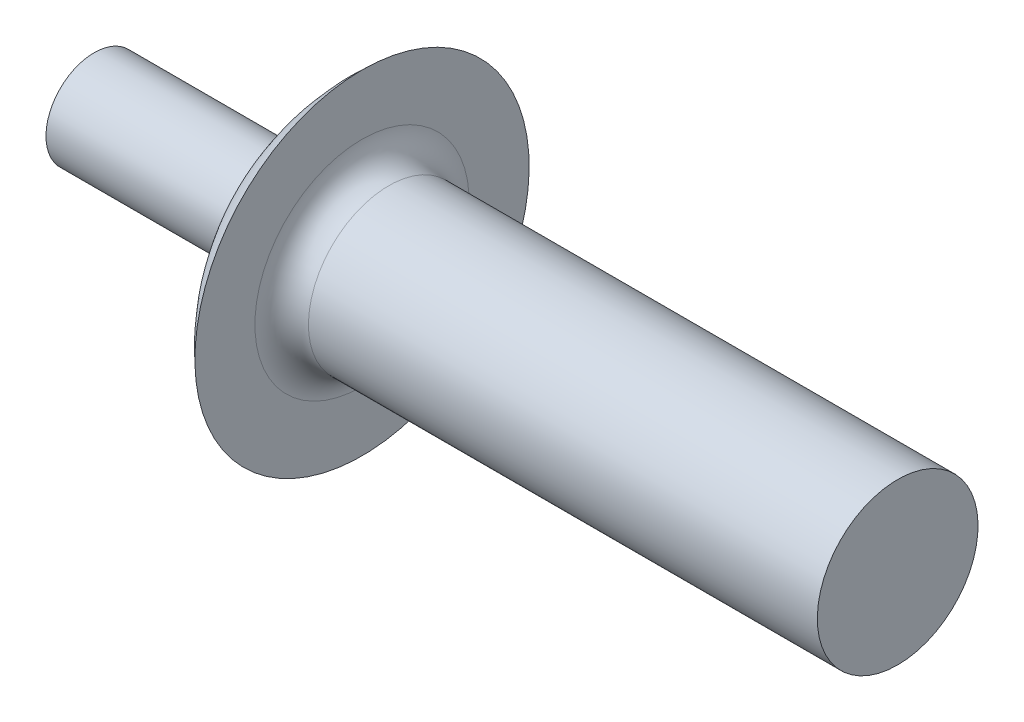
ISO-10303-21;
HEADER;
FILE_DESCRIPTION(('STEP AP214'),'2;1');
FILE_NAME('part.step','',(''),(''),'','','');
FILE_SCHEMA(('AUTOMOTIVE_DESIGN { 1 0 10303 214 1 1 1 1 }'));
ENDSEC;
DATA;
#1=APPLICATION_CONTEXT('core data for automotive mechanical design processes');
#2=APPLICATION_PROTOCOL_DEFINITION('international standard','automotive_design',2000,#1);
#3=PRODUCT_CONTEXT('',#1,'mechanical');
#4=PRODUCT('Part','Part','',(#3));
#5=PRODUCT_RELATED_PRODUCT_CATEGORY('part','',(#4));
#6=PRODUCT_DEFINITION_FORMATION('','',#4);
#7=PRODUCT_DEFINITION_CONTEXT('part definition',#1,'design');
#8=PRODUCT_DEFINITION('design','',#6,#7);
#9=PRODUCT_DEFINITION_SHAPE('','',#8);
#10=(LENGTH_UNIT() NAMED_UNIT(*) SI_UNIT(.MILLI.,.METRE.));
#11=(NAMED_UNIT(*) PLANE_ANGLE_UNIT() SI_UNIT($,.RADIAN.));
#12=(NAMED_UNIT(*) SI_UNIT($,.STERADIAN.) SOLID_ANGLE_UNIT());
#13=UNCERTAINTY_MEASURE_WITH_UNIT(LENGTH_MEASURE(1.E-05),#10,'distance_accuracy_value','');
#14=(GEOMETRIC_REPRESENTATION_CONTEXT(3) GLOBAL_UNCERTAINTY_ASSIGNED_CONTEXT((#13)) GLOBAL_UNIT_ASSIGNED_CONTEXT((#10,
#11,#12)) REPRESENTATION_CONTEXT('',''));
#15=CARTESIAN_POINT('',(0.,0.,0.));
#16=DIRECTION('',(0.,0.,1.));
#17=DIRECTION('',(1.,0.,0.));
#18=AXIS2_PLACEMENT_3D('',#15,#16,#17);
#19=CARTESIAN_POINT('',(15.,0.,0.));
#20=DIRECTION('',(-1.,0.,0.));
#21=DIRECTION('',(0.,-1.,0.));
#22=AXIS2_PLACEMENT_3D('',#19,#20,#21);
#23=PLANE('',#22);
#24=CARTESIAN_POINT('',(15.,0.,0.));
#25=DIRECTION('',(-1.,0.,0.));
#26=DIRECTION('',(0.,-1.,0.));
#27=AXIS2_PLACEMENT_3D('',#24,#25,#26);
#28=CIRCLE('',#27,1.5);
#29=CARTESIAN_POINT('',(15.,-1.5,0.));
#30=VERTEX_POINT('',#29);
#31=EDGE_CURVE('E42',#30,#30,#28,.T.);
#32=ORIENTED_EDGE('',*,*,#31,.F.);
#33=EDGE_LOOP('',(#32));
#34=FACE_BOUND('',#33,.T.);
#35=ADVANCED_FACE('F31',(#34),#23,.F.);
#36=CARTESIAN_POINT('',(-21.0963284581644,0.,0.));
#37=DIRECTION('',(-1.,0.,0.));
#38=DIRECTION('',(0.,-1.,0.));
#39=AXIS2_PLACEMENT_3D('',#36,#37,#38);
#40=CYLINDRICAL_SURFACE('',#39,1.5);
#41=CARTESIAN_POINT('',(5.5,0.,0.));
#42=DIRECTION('',(-1.,0.,0.));
#43=DIRECTION('',(0.,-1.,0.));
#44=AXIS2_PLACEMENT_3D('',#41,#42,#43);
#45=CIRCLE('',#44,1.5);
#46=CARTESIAN_POINT('',(5.5,-1.5,0.));
#47=VERTEX_POINT('',#46);
#48=EDGE_CURVE('E10',#47,#47,#45,.F.);
#49=ORIENTED_EDGE('',*,*,#48,.T.);
#50=EDGE_LOOP('',(#49));
#51=FACE_BOUND('',#50,.T.);
#52=ORIENTED_EDGE('',*,*,#31,.T.);
#53=EDGE_LOOP('',(#52));
#54=FACE_BOUND('',#53,.T.);
#55=ADVANCED_FACE('F74',(#51,#54),#40,.T.);
#56=CARTESIAN_POINT('',(5.,1.5,0.));
#57=DIRECTION('',(-1.,0.,0.));
#58=DIRECTION('',(0.,-1.,0.));
#59=AXIS2_PLACEMENT_3D('',#56,#57,#58);
#60=PLANE('',#59);
#61=CARTESIAN_POINT('',(5.,0.,0.));
#62=DIRECTION('',(-1.,0.,0.));
#63=DIRECTION('',(0.,-1.,0.));
#64=AXIS2_PLACEMENT_3D('',#61,#62,#63);
#65=CIRCLE('',#64,2.);
#66=CARTESIAN_POINT('',(5.,-2.,0.));
#67=VERTEX_POINT('',#66);
#68=EDGE_CURVE('E38',#67,#67,#65,.T.);
#69=ORIENTED_EDGE('',*,*,#68,.T.);
#70=EDGE_LOOP('',(#69));
#71=FACE_BOUND('',#70,.T.);
#72=CARTESIAN_POINT('',(5.,0.,0.));
#73=DIRECTION('',(-1.,0.,0.));
#74=DIRECTION('',(0.,-1.,0.));
#75=AXIS2_PLACEMENT_3D('',#72,#73,#74);
#76=CIRCLE('',#75,3.12);
#77=CARTESIAN_POINT('',(5.,3.12,0.));
#78=VERTEX_POINT('',#77);
#79=EDGE_CURVE('E46',#78,#78,#76,.T.);
#80=ORIENTED_EDGE('',*,*,#79,.F.);
#81=EDGE_LOOP('',(#80));
#82=FACE_BOUND('',#81,.T.);
#83=ADVANCED_FACE('F69',(#71,#82),#60,.F.);
#84=CARTESIAN_POINT('',(7.77657142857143,0.,0.));
#85=DIRECTION('',(-1.,0.,0.));
#86=DIRECTION('',(0.,1.,0.));
#87=AXIS2_PLACEMENT_3D('',#84,#85,#86);
#88=SPHERICAL_SURFACE('',#87,4.17657142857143);
#89=CARTESIAN_POINT('',(3.69812210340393,0.,0.));
#90=DIRECTION('',(-1.,0.,0.));
#91=DIRECTION('',(0.,-1.,0.));
#92=AXIS2_PLACEMENT_3D('',#89,#90,#91);
#93=CIRCLE('',#92,0.900000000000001);
#94=CARTESIAN_POINT('',(3.69812210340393,0.899999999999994,0.));
#95=VERTEX_POINT('',#94);
#96=EDGE_CURVE('E51',#95,#95,#93,.T.);
#97=CARTESIAN_POINT('',(3.69812210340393,0.899999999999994,0.));
#98=CARTESIAN_POINT('',(3.70399441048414,0.926611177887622,0.));
#99=CARTESIAN_POINT('',(3.71012723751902,0.953164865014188,0.));
#100=CARTESIAN_POINT('',(3.72291142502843,1.00614712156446,0.));
#101=CARTESIAN_POINT('',(3.72956278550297,1.03257569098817,0.));
#102=CARTESIAN_POINT('',(3.74338153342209,1.08529757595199,0.));
#103=CARTESIAN_POINT('',(3.75054892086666,1.11159089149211,0.));
#104=CARTESIAN_POINT('',(3.76539696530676,1.16403219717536,0.));
#105=CARTESIAN_POINT('',(3.77307762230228,1.19018018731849,0.));
#106=CARTESIAN_POINT('',(3.78894926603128,1.24232082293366,0.));
#107=CARTESIAN_POINT('',(3.79714025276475,1.2683134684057,0.));
#108=CARTESIAN_POINT('',(3.81402941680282,1.32013345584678,0.));
#109=CARTESIAN_POINT('',(3.82272759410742,1.34596079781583,0.));
#110=CARTESIAN_POINT('',(3.84062780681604,1.39744028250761,0.));
#111=CARTESIAN_POINT('',(3.84982984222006,1.42309242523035,0.));
#112=CARTESIAN_POINT('',(3.86873424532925,1.47421168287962,0.));
#113=CARTESIAN_POINT('',(3.87843661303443,1.49967879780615,0.));
#114=CARTESIAN_POINT('',(3.89833796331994,1.5504182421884,0.));
#115=CARTESIAN_POINT('',(3.90853694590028,1.57569057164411,0.));
#116=CARTESIAN_POINT('',(3.92942761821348,1.62603076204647,0.));
#117=CARTESIAN_POINT('',(3.94011930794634,1.65109862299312,0.));
#118=CARTESIAN_POINT('',(3.96199129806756,1.70102027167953,0.));
#119=CARTESIAN_POINT('',(3.9731715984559,1.72587405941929,0.));
#120=CARTESIAN_POINT('',(3.99601652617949,1.77535803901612,0.));
#121=CARTESIAN_POINT('',(4.00768115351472,1.79998823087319,0.));
#122=CARTESIAN_POINT('',(4.03149026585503,1.84901558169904,0.));
#123=CARTESIAN_POINT('',(4.04363475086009,1.87341274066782,0.));
#124=CARTESIAN_POINT('',(4.06839892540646,1.92196467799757,0.));
#125=CARTESIAN_POINT('',(4.08101861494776,1.94611945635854,0.));
#126=CARTESIAN_POINT('',(4.10672836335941,1.99417737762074,0.));
#127=CARTESIAN_POINT('',(4.11981842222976,2.01808052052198,0.));
#128=CARTESIAN_POINT('',(4.14646389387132,2.0656260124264,0.));
#129=CARTESIAN_POINT('',(4.16001930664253,2.08926836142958,0.));
#130=CARTESIAN_POINT('',(4.18759029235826,2.1362832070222,0.));
#131=CARTESIAN_POINT('',(4.20160586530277,2.15965570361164,0.));
#132=CARTESIAN_POINT('',(4.23009180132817,2.20612188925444,0.));
#133=CARTESIAN_POINT('',(4.24456216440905,2.22921557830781,0.));
#134=CARTESIAN_POINT('',(4.27395213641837,2.27511530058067,0.));
#135=CARTESIAN_POINT('',(4.28887174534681,2.29792133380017,0.));
#136=CARTESIAN_POINT('',(4.31915449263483,2.34323700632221,0.));
#137=CARTESIAN_POINT('',(4.33451763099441,2.36574664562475,0.));
#138=CARTESIAN_POINT('',(4.36568155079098,2.41046090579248,0.));
#139=CARTESIAN_POINT('',(4.38148233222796,2.43266552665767,0.));
#140=CARTESIAN_POINT('',(4.4135154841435,2.47676124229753,0.));
#141=CARTESIAN_POINT('',(4.42974785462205,2.4986523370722,0.));
#142=CARTESIAN_POINT('',(4.46263796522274,2.54211261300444,0.));
#143=CARTESIAN_POINT('',(4.47929570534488,2.56368179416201,0.));
#144=CARTESIAN_POINT('',(4.51303017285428,2.60648997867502,0.));
#145=CARTESIAN_POINT('',(4.53010690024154,2.62772898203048,0.));
#146=CARTESIAN_POINT('',(4.56467279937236,2.6698686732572,0.));
#147=CARTESIAN_POINT('',(4.58216197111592,2.69076936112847,0.));
#148=CARTESIAN_POINT('',(4.61754605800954,2.73222441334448,0.));
#149=CARTESIAN_POINT('',(4.6354409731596,2.75277877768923,0.));
#150=CARTESIAN_POINT('',(4.67162969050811,2.79353330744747,0.));
#151=CARTESIAN_POINT('',(4.68992349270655,2.81373347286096,0.));
#152=CARTESIAN_POINT('',(4.7269029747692,2.85377186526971,0.));
#153=CARTESIAN_POINT('',(4.74558865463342,2.87361009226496,0.));
#154=CARTESIAN_POINT('',(4.78334473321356,2.912917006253,0.));
#155=CARTESIAN_POINT('',(4.8024151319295,2.9323856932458,0.));
#156=CARTESIAN_POINT('',(4.84093333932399,2.97094607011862,0.));
#157=CARTESIAN_POINT('',(4.86038114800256,2.99003775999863,0.));
#158=CARTESIAN_POINT('',(4.89964673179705,3.0278368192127,0.));
#159=CARTESIAN_POINT('',(4.91946450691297,3.04654418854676,0.));
#160=CARTESIAN_POINT('',(4.95946240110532,3.08356747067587,0.));
#161=CARTESIAN_POINT('',(4.97964252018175,3.10188338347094,0.));
#162=CARTESIAN_POINT('',(5.,3.12,0.));
#163=B_SPLINE_CURVE_WITH_KNOTS('',3,(#97,#98,#99,#100,#101,#102,#103,#104,#105,#106,#107,#108,
#109,#110,#111,#112,#113,#114,#115,#116,#117,#118,#119,#120,#121,#122,#123,#124,#125,#126,#127,
#128,#129,#130,#131,#132,#133,#134,#135,#136,#137,#138,#139,#140,#141,#142,#143,#144,#145,#146,
#147,#148,#149,#150,#151,#152,#153,#154,#155,#156,#157,#158,#159,#160,#161,#162),.UNSPECIFIED.,
.F.,.F.,(4,2,2,2,2,2,2,2,2,2,2,2,2,2,2,2,2,2,2,2,2,2,2,2,2,2,2,2,2,2,2,2,4),(0.,
0.0817528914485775,0.163505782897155,0.245258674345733,0.327011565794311,0.408764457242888,
0.490517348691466,0.572270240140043,0.654023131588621,0.735776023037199,0.817528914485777,
0.899281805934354,0.981034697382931,1.06278758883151,1.14454048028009,1.22629337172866,
1.30804626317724,1.38979915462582,1.4715520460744,1.55330493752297,1.63505782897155,
1.71681072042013,1.79856361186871,1.88031650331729,1.96206939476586,2.04382228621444,
2.12557517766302,2.2073280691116,2.28908096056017,2.37083385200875,2.45258674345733,
2.53433963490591,2.61609252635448),.UNSPECIFIED.);
#164=EDGE_CURVE('BSEAM63',#95,#78,#163,.T.);
#165=ORIENTED_EDGE('',*,*,#96,.F.);
#166=ORIENTED_EDGE('',*,*,#79,.T.);
#167=ORIENTED_EDGE('',*,*,#164,.T.);
#168=ORIENTED_EDGE('',*,*,#164,.F.);
#169=EDGE_LOOP('',(#165,#167,#166,#168));
#170=FACE_BOUND('',#169,.T.);
#171=ADVANCED_FACE('F63',(#170),#88,.T.);
#172=CARTESIAN_POINT('',(-21.0963284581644,0.,0.));
#173=DIRECTION('',(-1.,0.,0.));
#174=DIRECTION('',(0.,-1.,0.));
#175=AXIS2_PLACEMENT_3D('',#172,#173,#174);
#176=CYLINDRICAL_SURFACE('',#175,0.900000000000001);
#177=CARTESIAN_POINT('',(0.,0.,0.));
#178=DIRECTION('',(-1.,0.,0.));
#179=DIRECTION('',(0.,-1.,0.));
#180=AXIS2_PLACEMENT_3D('',#177,#178,#179);
#181=CIRCLE('',#180,0.900000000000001);
#182=CARTESIAN_POINT('',(0.,-0.9,0.));
#183=VERTEX_POINT('',#182);
#184=EDGE_CURVE('E54',#183,#183,#181,.T.);
#185=ORIENTED_EDGE('',*,*,#184,.F.);
#186=EDGE_LOOP('',(#185));
#187=FACE_BOUND('',#186,.T.);
#188=ORIENTED_EDGE('',*,*,#96,.T.);
#189=EDGE_LOOP('',(#188));
#190=FACE_BOUND('',#189,.T.);
#191=ADVANCED_FACE('F60',(#187,#190),#176,.T.);
#192=CARTESIAN_POINT('',(0.,0.900000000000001,0.));
#193=DIRECTION('',(1.,0.,0.));
#194=DIRECTION('',(0.,1.,0.));
#195=AXIS2_PLACEMENT_3D('',#192,#193,#194);
#196=PLANE('',#195);
#197=ORIENTED_EDGE('',*,*,#184,.T.);
#198=EDGE_LOOP('',(#197));
#199=FACE_BOUND('',#198,.T.);
#200=ADVANCED_FACE('F58',(#199),#196,.F.);
#201=CARTESIAN_POINT('',(5.5,0.,0.));
#202=DIRECTION('',(-1.,0.,0.));
#203=DIRECTION('',(0.,-1.,0.));
#204=AXIS2_PLACEMENT_3D('',#201,#202,#203);
#205=TOROIDAL_SURFACE('',#204,2.,0.5);
#206=ORIENTED_EDGE('',*,*,#48,.F.);
#207=EDGE_LOOP('',(#206));
#208=FACE_BOUND('',#207,.T.);
#209=ORIENTED_EDGE('',*,*,#68,.F.);
#210=EDGE_LOOP('',(#209));
#211=FACE_BOUND('',#210,.T.);
#212=ADVANCED_FACE('F33',(#208,#211),#205,.F.);
#213=CLOSED_SHELL('',(#35,#55,#83,#171,#191,#200,#212));
#214=MANIFOLD_SOLID_BREP('B2',#213);
#215=ADVANCED_BREP_SHAPE_REPRESENTATION('',(#18,#214),#14);
#216=SHAPE_DEFINITION_REPRESENTATION(#9,#215);
ENDSEC;
END-ISO-10303-21;
